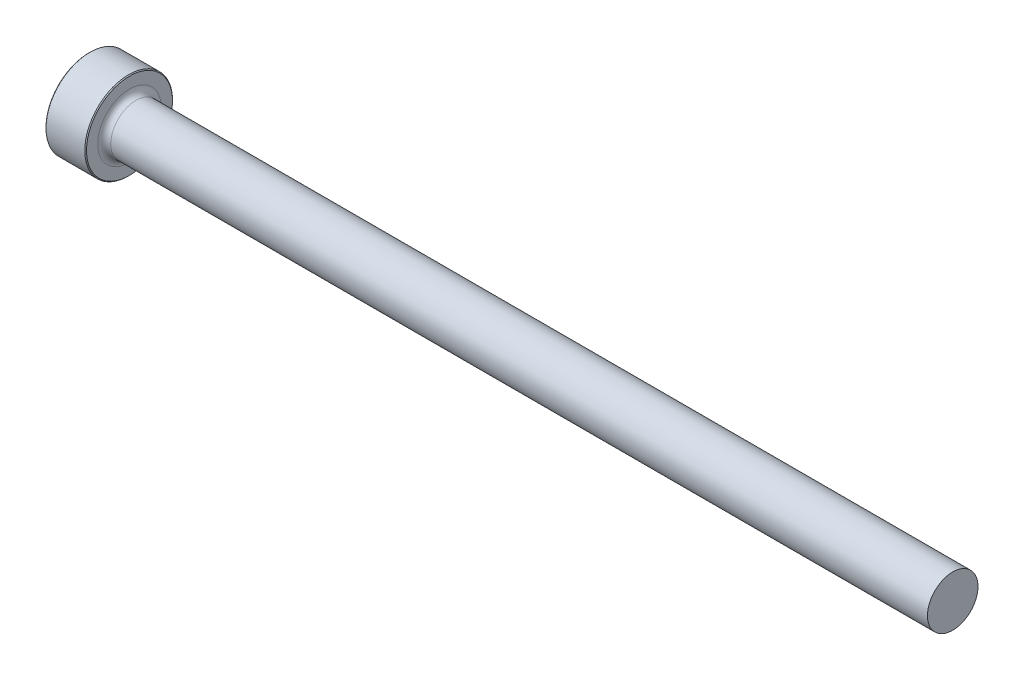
ISO-10303-21;
HEADER;
FILE_DESCRIPTION(('STEP AP214'),'2;1');
FILE_NAME('part.step','',(''),(''),'','','');
FILE_SCHEMA(('AUTOMOTIVE_DESIGN { 1 0 10303 214 1 1 1 1 }'));
ENDSEC;
DATA;
#1=APPLICATION_CONTEXT('core data for automotive mechanical design processes');
#2=APPLICATION_PROTOCOL_DEFINITION('international standard','automotive_design',2000,#1);
#3=PRODUCT_CONTEXT('',#1,'mechanical');
#4=PRODUCT('Part','Part','',(#3));
#5=PRODUCT_RELATED_PRODUCT_CATEGORY('part','',(#4));
#6=PRODUCT_DEFINITION_FORMATION('','',#4);
#7=PRODUCT_DEFINITION_CONTEXT('part definition',#1,'design');
#8=PRODUCT_DEFINITION('design','',#6,#7);
#9=PRODUCT_DEFINITION_SHAPE('','',#8);
#10=(LENGTH_UNIT() NAMED_UNIT(*) SI_UNIT(.MILLI.,.METRE.));
#11=(NAMED_UNIT(*) PLANE_ANGLE_UNIT() SI_UNIT($,.RADIAN.));
#12=(NAMED_UNIT(*) SI_UNIT($,.STERADIAN.) SOLID_ANGLE_UNIT());
#13=UNCERTAINTY_MEASURE_WITH_UNIT(LENGTH_MEASURE(1.E-05),#10,'distance_accuracy_value','');
#14=(GEOMETRIC_REPRESENTATION_CONTEXT(3) GLOBAL_UNCERTAINTY_ASSIGNED_CONTEXT((#13)) GLOBAL_UNIT_ASSIGNED_CONTEXT((#10,
#11,#12)) REPRESENTATION_CONTEXT('',''));
#15=CARTESIAN_POINT('',(0.,0.,0.));
#16=DIRECTION('',(0.,0.,1.));
#17=DIRECTION('',(1.,0.,0.));
#18=AXIS2_PLACEMENT_3D('',#15,#16,#17);
#19=CARTESIAN_POINT('',(101.6,2.97275249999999,0.));
#20=DIRECTION('',(1.,0.,0.));
#21=DIRECTION('',(0.,1.,0.));
#22=AXIS2_PLACEMENT_3D('',#19,#20,#21);
#23=PLANE('',#22);
#24=CARTESIAN_POINT('',(101.6,0.,0.));
#25=DIRECTION('',(1.,0.,0.));
#26=DIRECTION('',(0.,1.,0.));
#27=AXIS2_PLACEMENT_3D('',#24,#25,#26);
#28=CIRCLE('',#27,2.9727525);
#29=CARTESIAN_POINT('',(101.6,2.97275249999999,0.));
#30=VERTEX_POINT('',#29);
#31=EDGE_CURVE('E50',#30,#30,#28,.T.);
#32=ORIENTED_EDGE('',*,*,#31,.T.);
#33=EDGE_LOOP('',(#32));
#34=FACE_BOUND('',#33,.T.);
#35=ADVANCED_FACE('F30',(#34),#23,.T.);
#36=CARTESIAN_POINT('',(101.6,0.,0.));
#37=DIRECTION('',(1.,0.,0.));
#38=DIRECTION('',(0.,1.,0.));
#39=AXIS2_PLACEMENT_3D('',#36,#37,#38);
#40=CYLINDRICAL_SURFACE('',#39,2.9727525);
#41=CARTESIAN_POINT('',(5.5245,0.,0.));
#42=DIRECTION('',(1.,0.,0.));
#43=DIRECTION('',(0.,1.,0.));
#44=AXIS2_PLACEMENT_3D('',#41,#42,#43);
#45=CIRCLE('',#44,2.97275249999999);
#46=CARTESIAN_POINT('',(5.5245,2.97275249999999,0.));
#47=VERTEX_POINT('',#46);
#48=EDGE_CURVE('E53',#47,#47,#45,.T.);
#49=ORIENTED_EDGE('',*,*,#48,.T.);
#50=EDGE_LOOP('',(#49));
#51=FACE_BOUND('',#50,.T.);
#52=ORIENTED_EDGE('',*,*,#31,.F.);
#53=EDGE_LOOP('',(#52));
#54=FACE_BOUND('',#53,.T.);
#55=ADVANCED_FACE('F74',(#51,#54),#40,.T.);
#56=CARTESIAN_POINT('',(5.5245,0.,0.));
#57=DIRECTION('',(1.,0.,0.));
#58=DIRECTION('',(0.,1.,0.));
#59=AXIS2_PLACEMENT_3D('',#56,#57,#58);
#60=TOROIDAL_SURFACE('',#59,3.73475249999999,0.762);
#61=CARTESIAN_POINT('',(4.7625,0.,0.));
#62=DIRECTION('',(1.,0.,0.));
#63=DIRECTION('',(0.,1.,0.));
#64=AXIS2_PLACEMENT_3D('',#61,#62,#63);
#65=CIRCLE('',#64,3.73475249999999);
#66=CARTESIAN_POINT('',(4.7625,3.73475249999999,0.));
#67=VERTEX_POINT('',#66);
#68=EDGE_CURVE('E56',#67,#67,#65,.T.);
#69=ORIENTED_EDGE('',*,*,#68,.T.);
#70=EDGE_LOOP('',(#69));
#71=FACE_BOUND('',#70,.T.);
#72=ORIENTED_EDGE('',*,*,#48,.F.);
#73=EDGE_LOOP('',(#72));
#74=FACE_BOUND('',#73,.T.);
#75=ADVANCED_FACE('F60',(#71,#74),#60,.F.);
#76=CARTESIAN_POINT('',(4.7625,5.159375,0.));
#77=DIRECTION('',(1.,0.,0.));
#78=DIRECTION('',(0.,1.,0.));
#79=AXIS2_PLACEMENT_3D('',#76,#77,#78);
#80=PLANE('',#79);
#81=CARTESIAN_POINT('',(4.7625,0.,0.));
#82=DIRECTION('',(1.,0.,0.));
#83=DIRECTION('',(0.,1.,0.));
#84=AXIS2_PLACEMENT_3D('',#81,#82,#83);
#85=CIRCLE('',#84,5.05777499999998);
#86=CARTESIAN_POINT('',(4.7625,5.05777499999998,0.));
#87=VERTEX_POINT('',#86);
#88=EDGE_CURVE('E10',#87,#87,#85,.T.);
#89=ORIENTED_EDGE('',*,*,#88,.T.);
#90=EDGE_LOOP('',(#89));
#91=FACE_BOUND('',#90,.T.);
#92=ORIENTED_EDGE('',*,*,#68,.F.);
#93=EDGE_LOOP('',(#92));
#94=FACE_BOUND('',#93,.T.);
#95=ADVANCED_FACE('F63',(#91,#94),#80,.T.);
#96=CARTESIAN_POINT('',(101.6,0.,0.));
#97=DIRECTION('',(1.,0.,0.));
#98=DIRECTION('',(0.,1.,0.));
#99=AXIS2_PLACEMENT_3D('',#96,#97,#98);
#100=CYLINDRICAL_SURFACE('',#99,5.159375);
#101=CARTESIAN_POINT('',(0.101599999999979,0.,0.));
#102=DIRECTION('',(-1.,0.,0.));
#103=DIRECTION('',(0.,-1.,0.));
#104=AXIS2_PLACEMENT_3D('',#101,#102,#103);
#105=CIRCLE('',#104,5.159375);
#106=CARTESIAN_POINT('',(0.101599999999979,-5.159375,0.));
#107=VERTEX_POINT('',#106);
#108=EDGE_CURVE('E41',#107,#107,#105,.F.);
#109=ORIENTED_EDGE('',*,*,#108,.T.);
#110=EDGE_LOOP('',(#109));
#111=FACE_BOUND('',#110,.T.);
#112=CARTESIAN_POINT('',(4.66089999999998,0.,0.));
#113=DIRECTION('',(1.,0.,0.));
#114=DIRECTION('',(0.,1.,0.));
#115=AXIS2_PLACEMENT_3D('',#112,#113,#114);
#116=CIRCLE('',#115,5.159375);
#117=CARTESIAN_POINT('',(4.66089999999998,5.159375,0.));
#118=VERTEX_POINT('',#117);
#119=EDGE_CURVE('E45',#118,#118,#116,.F.);
#120=ORIENTED_EDGE('',*,*,#119,.T.);
#121=EDGE_LOOP('',(#120));
#122=FACE_BOUND('',#121,.T.);
#123=ADVANCED_FACE('F65',(#111,#122),#100,.T.);
#124=CARTESIAN_POINT('',(0.,0.,0.));
#125=DIRECTION('',(-1.,0.,0.));
#126=DIRECTION('',(0.,-1.,0.));
#127=AXIS2_PLACEMENT_3D('',#124,#125,#126);
#128=PLANE('',#127);
#129=CARTESIAN_POINT('',(0.,0.,0.));
#130=DIRECTION('',(-1.,0.,0.));
#131=DIRECTION('',(0.,-1.,0.));
#132=AXIS2_PLACEMENT_3D('',#129,#130,#131);
#133=CIRCLE('',#132,5.05777500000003);
#134=CARTESIAN_POINT('',(0.,-5.05777500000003,0.));
#135=VERTEX_POINT('',#134);
#136=EDGE_CURVE('E37',#135,#135,#133,.T.);
#137=ORIENTED_EDGE('',*,*,#136,.T.);
#138=EDGE_LOOP('',(#137));
#139=FACE_BOUND('',#138,.T.);
#140=ADVANCED_FACE('F71',(#139),#128,.T.);
#141=CARTESIAN_POINT('',(0.101599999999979,0.,0.));
#142=DIRECTION('',(1.,0.,0.));
#143=DIRECTION('',(0.,1.,0.));
#144=AXIS2_PLACEMENT_3D('',#141,#142,#143);
#145=CONICAL_SURFACE('',#144,5.159375,0.78539816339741);
#146=ORIENTED_EDGE('',*,*,#136,.F.);
#147=EDGE_LOOP('',(#146));
#148=FACE_BOUND('',#147,.T.);
#149=ORIENTED_EDGE('',*,*,#108,.F.);
#150=EDGE_LOOP('',(#149));
#151=FACE_BOUND('',#150,.T.);
#152=ADVANCED_FACE('F84',(#148,#151),#145,.T.);
#153=CARTESIAN_POINT('',(4.7625,0.,0.));
#154=DIRECTION('',(-1.,0.,0.));
#155=DIRECTION('',(0.,-1.,0.));
#156=AXIS2_PLACEMENT_3D('',#153,#154,#155);
#157=CONICAL_SURFACE('',#156,5.05777499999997,0.785398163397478);
#158=ORIENTED_EDGE('',*,*,#119,.F.);
#159=EDGE_LOOP('',(#158));
#160=FACE_BOUND('',#159,.T.);
#161=ORIENTED_EDGE('',*,*,#88,.F.);
#162=EDGE_LOOP('',(#161));
#163=FACE_BOUND('',#162,.T.);
#164=ADVANCED_FACE('F32',(#160,#163),#157,.T.);
#165=CLOSED_SHELL('',(#35,#55,#75,#95,#123,#140,#152,#164));
#166=MANIFOLD_SOLID_BREP('B2',#165);
#167=ADVANCED_BREP_SHAPE_REPRESENTATION('',(#18,#166),#14);
#168=SHAPE_DEFINITION_REPRESENTATION(#9,#167);
ENDSEC;
END-ISO-10303-21;
